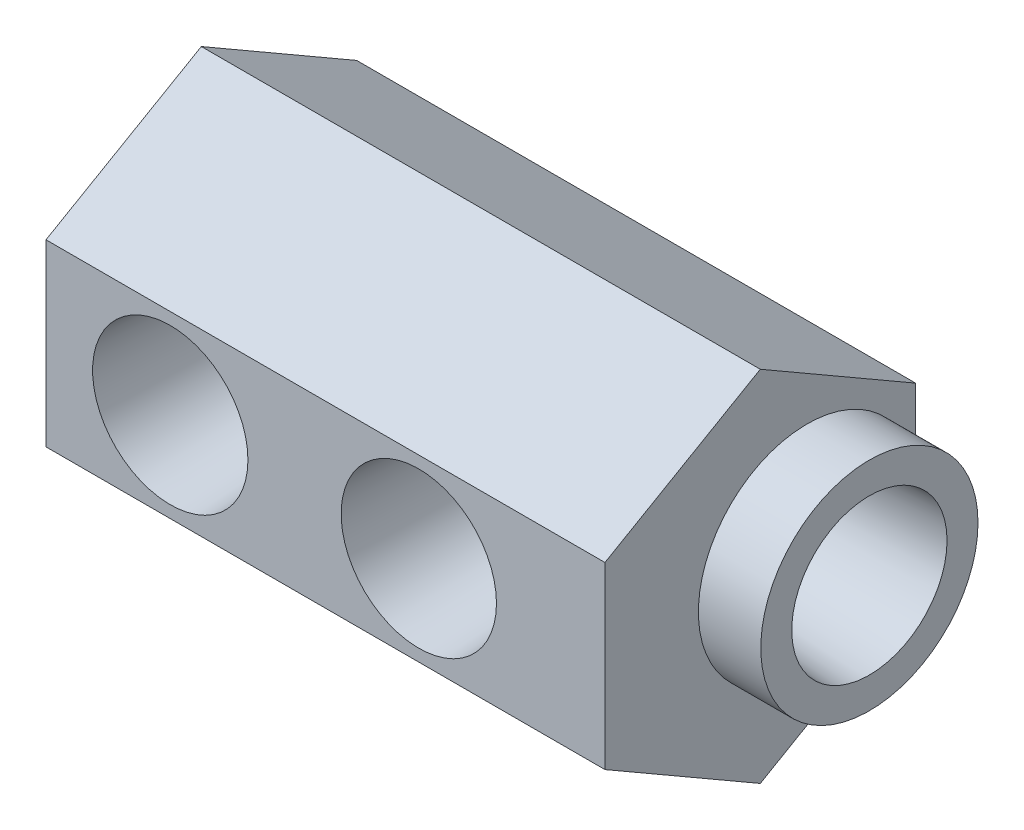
ISO-10303-21;
HEADER;
FILE_DESCRIPTION(('STEP AP214'),'2;1');
FILE_NAME('part.step','',(''),(''),'','','');
FILE_SCHEMA(('AUTOMOTIVE_DESIGN { 1 0 10303 214 1 1 1 1 }'));
ENDSEC;
DATA;
#1=APPLICATION_CONTEXT('core data for automotive mechanical design processes');
#2=APPLICATION_PROTOCOL_DEFINITION('international standard','automotive_design',2000,#1);
#3=PRODUCT_CONTEXT('',#1,'mechanical');
#4=PRODUCT('Part','Part','',(#3));
#5=PRODUCT_RELATED_PRODUCT_CATEGORY('part','',(#4));
#6=PRODUCT_DEFINITION_FORMATION('','',#4);
#7=PRODUCT_DEFINITION_CONTEXT('part definition',#1,'design');
#8=PRODUCT_DEFINITION('design','',#6,#7);
#9=PRODUCT_DEFINITION_SHAPE('','',#8);
#10=(LENGTH_UNIT() NAMED_UNIT(*) SI_UNIT(.MILLI.,.METRE.));
#11=(NAMED_UNIT(*) PLANE_ANGLE_UNIT() SI_UNIT($,.RADIAN.));
#12=(NAMED_UNIT(*) SI_UNIT($,.STERADIAN.) SOLID_ANGLE_UNIT());
#13=UNCERTAINTY_MEASURE_WITH_UNIT(LENGTH_MEASURE(1.E-05),#10,'distance_accuracy_value','');
#14=(GEOMETRIC_REPRESENTATION_CONTEXT(3) GLOBAL_UNCERTAINTY_ASSIGNED_CONTEXT((#13)) GLOBAL_UNIT_ASSIGNED_CONTEXT((#10,
#11,#12)) REPRESENTATION_CONTEXT('',''));
#15=CARTESIAN_POINT('',(0.,0.,0.));
#16=DIRECTION('',(0.,0.,1.));
#17=DIRECTION('',(1.,0.,0.));
#18=AXIS2_PLACEMENT_3D('',#15,#16,#17);
#19=CARTESIAN_POINT('',(9.39799990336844,0.,3.33536219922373));
#20=DIRECTION('',(1.,0.,0.));
#21=DIRECTION('',(0.,0.,-1.));
#22=AXIS2_PLACEMENT_3D('',#19,#20,#21);
#23=PLANE('',#22);
#24=DIRECTION('',(0.,1.,0.));
#25=VECTOR('',#24,1.);
#26=CARTESIAN_POINT('',(9.39799990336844,0.,4.21608249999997));
#27=LINE('',#26,#25);
#28=CARTESIAN_POINT('',(9.39799990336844,-0.889000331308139,4.21608249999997));
#29=VERTEX_POINT('',#28);
#30=CARTESIAN_POINT('',(9.39799990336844,0.889000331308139,4.21608249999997));
#31=VERTEX_POINT('',#30);
#32=EDGE_CURVE('E11',#29,#31,#27,.T.);
#33=ORIENTED_EDGE('',*,*,#32,.F.);
#34=DIRECTION('',(0.,0.,1.));
#35=VECTOR('',#34,1.);
#36=CARTESIAN_POINT('',(9.39799990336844,-0.889000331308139,19.8052254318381));
#37=LINE('',#36,#35);
#38=CARTESIAN_POINT('',(9.39799990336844,-0.889000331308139,4.55639409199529));
#39=VERTEX_POINT('',#38);
#40=EDGE_CURVE('E175',#39,#29,#37,.F.);
#41=ORIENTED_EDGE('',*,*,#40,.F.);
#42=CARTESIAN_POINT('',(9.39799990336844,0.,5.5499));
#43=DIRECTION('',(1.,0.,0.));
#44=DIRECTION('',(0.,0.,-1.));
#45=AXIS2_PLACEMENT_3D('',#42,#43,#44);
#46=CIRCLE('',#45,1.3331825);
#47=CARTESIAN_POINT('',(9.39799990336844,-0.889000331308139,6.54340590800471));
#48=VERTEX_POINT('',#47);
#49=EDGE_CURVE('E194',#39,#48,#46,.F.);
#50=ORIENTED_EDGE('',*,*,#49,.T.);
#51=CARTESIAN_POINT('',(9.39799990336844,-0.889000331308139,7.36297774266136));
#52=VERTEX_POINT('',#51);
#53=EDGE_CURVE('E174',#52,#48,#37,.F.);
#54=ORIENTED_EDGE('',*,*,#53,.F.);
#55=CARTESIAN_POINT('',(9.39799990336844,0.,5.5499));
#56=DIRECTION('',(1.,0.,0.));
#57=DIRECTION('',(0.,0.,-1.));
#58=AXIS2_PLACEMENT_3D('',#55,#56,#57);
#59=CIRCLE('',#58,2.0193);
#60=CARTESIAN_POINT('',(9.39799990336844,0.889000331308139,7.36297774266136));
#61=VERTEX_POINT('',#60);
#62=EDGE_CURVE('E195',#52,#61,#59,.T.);
#63=ORIENTED_EDGE('',*,*,#62,.T.);
#64=DIRECTION('',(0.,0.,1.));
#65=VECTOR('',#64,1.);
#66=CARTESIAN_POINT('',(9.39799990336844,0.889000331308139,19.8052254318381));
#67=LINE('',#66,#65);
#68=CARTESIAN_POINT('',(9.39799990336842,0.889000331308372,6.54340590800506));
#69=VERTEX_POINT('',#68);
#70=EDGE_CURVE('E111',#69,#61,#67,.T.);
#71=ORIENTED_EDGE('',*,*,#70,.F.);
#72=CARTESIAN_POINT('',(9.39799990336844,0.889000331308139,4.55639409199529));
#73=VERTEX_POINT('',#72);
#74=EDGE_CURVE('E198',#69,#73,#46,.F.);
#75=ORIENTED_EDGE('',*,*,#74,.T.);
#76=EDGE_CURVE('E533',#31,#73,#67,.T.);
#77=ORIENTED_EDGE('',*,*,#76,.F.);
#78=EDGE_LOOP('',(#33,#41,#50,#54,#63,#71,#75,#77));
#79=FACE_BOUND('',#78,.T.);
#80=ADVANCED_FACE('F17',(#79),#23,.T.);
#81=CARTESIAN_POINT('',(6.35,0.,19.8052254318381));
#82=DIRECTION('',(0.,0.,1.));
#83=DIRECTION('',(1.,0.,0.));
#84=AXIS2_PLACEMENT_3D('',#81,#82,#83);
#85=CYLINDRICAL_SURFACE('',#84,3.175);
#86=CARTESIAN_POINT('',(6.35,0.,7.9371825));
#87=DIRECTION('',(0.,0.,1.));
#88=DIRECTION('',(1.,0.,0.));
#89=AXIS2_PLACEMENT_3D('',#86,#87,#88);
#90=CIRCLE('',#89,3.175);
#91=CARTESIAN_POINT('',(9.525,0.,7.9371825));
#92=VERTEX_POINT('',#91);
#93=EDGE_CURVE('E131',#92,#92,#90,.T.);
#94=ORIENTED_EDGE('',*,*,#93,.T.);
#95=EDGE_LOOP('',(#94));
#96=FACE_BOUND('',#95,.T.);
#97=CARTESIAN_POINT('',(9.39799990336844,-0.889000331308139,7.36297774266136));
#98=CARTESIAN_POINT('',(9.41071185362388,-0.845420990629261,7.38434426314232));
#99=CARTESIAN_POINT('',(9.42267780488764,-0.800908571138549,7.40422073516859));
#100=CARTESIAN_POINT('',(9.44490964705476,-0.710172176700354,7.44083291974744));
#101=CARTESIAN_POINT('',(9.45517461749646,-0.663947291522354,7.45756693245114));
#102=CARTESIAN_POINT('',(9.48308342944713,-0.523021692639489,7.5027774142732));
#103=CARTESIAN_POINT('',(9.49784491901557,-0.426057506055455,7.52626851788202));
#104=CARTESIAN_POINT('',(9.51833226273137,-0.228469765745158,7.55873965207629));
#105=CARTESIAN_POINT('',(9.52402784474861,-0.127835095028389,7.56767106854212));
#106=CARTESIAN_POINT('',(9.52574094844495,0.0736474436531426,7.57036538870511));
#107=CARTESIAN_POINT('',(9.52176745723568,0.174495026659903,7.56414237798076));
#108=CARTESIAN_POINT('',(9.50493333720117,0.368988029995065,7.53752387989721));
#109=CARTESIAN_POINT('',(9.49246567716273,0.462756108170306,7.51775485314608));
#110=CARTESIAN_POINT('',(9.46011167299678,0.645294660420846,7.46566632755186));
#111=CARTESIAN_POINT('',(9.44023258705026,0.734069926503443,7.43335910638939));
#112=CARTESIAN_POINT('',(9.41116730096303,0.842899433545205,7.3850450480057));
#113=CARTESIAN_POINT('',(9.40468573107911,0.866087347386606,7.37421543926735));
#114=CARTESIAN_POINT('',(9.39799990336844,0.889000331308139,7.36297774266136));
#115=B_SPLINE_CURVE_WITH_KNOTS('',3,(#97,#98,#99,#100,#101,#102,#103,#104,#105,#106,#107,#108,
#109,#110,#111,#112,#113,#114),.UNSPECIFIED.,.F.,.F.,(4,2,2,2,2,2,2,2,4),(0.,0.150448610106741,
0.300978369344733,0.601994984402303,0.904014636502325,1.20575367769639,1.49440434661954,
1.78277307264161,1.86194685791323),.UNSPECIFIED.);
#116=EDGE_CURVE('E24',#52,#61,#115,.T.);
#117=ORIENTED_EDGE('',*,*,#116,.F.);
#118=ORIENTED_EDGE('',*,*,#53,.T.);
#119=CARTESIAN_POINT('',(9.525,0.,6.8830825));
#120=CARTESIAN_POINT('',(9.52499408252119,0.0713665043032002,6.88307465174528));
#121=CARTESIAN_POINT('',(9.52256596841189,0.142842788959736,6.87731811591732));
#122=CARTESIAN_POINT('',(9.51308742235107,0.283767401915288,6.85449749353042));
#123=CARTESIAN_POINT('',(9.50602503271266,0.353209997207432,6.83740415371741));
#124=CARTESIAN_POINT('',(9.48803626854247,0.487796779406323,6.79265472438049));
#125=CARTESIAN_POINT('',(9.47712307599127,0.552954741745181,6.76503464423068));
#126=CARTESIAN_POINT('',(9.45249294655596,0.677648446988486,6.70016555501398));
#127=CARTESIAN_POINT('',(9.43877683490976,0.737185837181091,6.6629193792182));
#128=CARTESIAN_POINT('',(9.40913120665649,0.852069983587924,6.57785674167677));
#129=CARTESIAN_POINT('',(9.39312847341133,0.907093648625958,6.52962966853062));
#130=CARTESIAN_POINT('',(9.36102774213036,1.00855050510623,6.42484275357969));
#131=CARTESIAN_POINT('',(9.34492969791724,1.05497910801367,6.36827848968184));
#132=CARTESIAN_POINT('',(9.31355689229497,1.14022995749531,6.24498529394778));
#133=CARTESIAN_POINT('',(9.2983639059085,1.17855397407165,6.177888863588));
#134=CARTESIAN_POINT('',(9.27168497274,1.24322763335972,6.03747205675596));
#135=CARTESIAN_POINT('',(9.26019708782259,1.26958353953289,5.96415495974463));
#136=CARTESIAN_POINT('',(9.24302277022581,1.30823334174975,5.81709718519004));
#137=CARTESIAN_POINT('',(9.23708103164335,1.32114960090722,5.74355105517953));
#138=CARTESIAN_POINT('',(9.23093891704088,1.33449455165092,5.59511387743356));
#139=CARTESIAN_POINT('',(9.23073530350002,1.3349302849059,5.52022361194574));
#140=CARTESIAN_POINT('',(9.23587671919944,1.32377003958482,5.37746833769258));
#141=CARTESIAN_POINT('',(9.24078972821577,1.31311089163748,5.30951138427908));
#142=CARTESIAN_POINT('',(9.25487976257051,1.2816367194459,5.17645871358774));
#143=CARTESIAN_POINT('',(9.26405761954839,1.26081971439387,5.11136355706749));
#144=CARTESIAN_POINT('',(9.28585141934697,1.20921355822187,4.98422522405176));
#145=CARTESIAN_POINT('',(9.29853683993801,1.17822022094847,4.9222773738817));
#146=CARTESIAN_POINT('',(9.32590087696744,1.10728579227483,4.80421836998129));
#147=CARTESIAN_POINT('',(9.34058028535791,1.06734114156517,4.74810955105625));
#148=CARTESIAN_POINT('',(9.37181300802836,0.975608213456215,4.63824515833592));
#149=CARTESIAN_POINT('',(9.38841893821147,0.923097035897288,4.58510641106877));
#150=CARTESIAN_POINT('',(9.42057058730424,0.80974657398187,4.4881804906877));
#151=CARTESIAN_POINT('',(9.43611604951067,0.748905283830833,4.44439557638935));
#152=CARTESIAN_POINT('',(9.46485943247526,0.618722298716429,4.36649636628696));
#153=CARTESIAN_POINT('',(9.47799276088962,0.549212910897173,4.33263671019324));
#154=CARTESIAN_POINT('',(9.49993478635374,0.404792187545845,4.27730855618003));
#155=CARTESIAN_POINT('',(9.50874591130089,0.329883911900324,4.25583310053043));
#156=CARTESIAN_POINT('',(9.520595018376,0.18194332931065,4.22718264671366));
#157=CARTESIAN_POINT('',(9.52396650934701,0.109097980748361,4.21918008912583));
#158=CARTESIAN_POINT('',(9.52562380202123,-0.0369669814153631,4.21523073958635));
#159=CARTESIAN_POINT('',(9.52391109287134,-0.110186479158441,4.21928041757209));
#160=CARTESIAN_POINT('',(9.51580826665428,-0.251021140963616,4.23873145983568));
#161=CARTESIAN_POINT('',(9.50965907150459,-0.318732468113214,4.25354839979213));
#162=CARTESIAN_POINT('',(9.4935605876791,-0.450632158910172,4.29329637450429));
#163=CARTESIAN_POINT('',(9.48361082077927,-0.514820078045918,4.31822868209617));
#164=CARTESIAN_POINT('',(9.46047812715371,-0.640107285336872,4.37831316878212));
#165=CARTESIAN_POINT('',(9.44720421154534,-0.701048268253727,4.41375927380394));
#166=CARTESIAN_POINT('',(9.41883547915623,-0.816335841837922,4.4935426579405));
#167=CARTESIAN_POINT('',(9.4037398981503,-0.870679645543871,4.53788367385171));
#168=CARTESIAN_POINT('',(9.37199865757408,-0.975374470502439,4.63795893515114));
#169=CARTESIAN_POINT('',(9.35531998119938,-1.0251500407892,4.69428625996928));
#170=CARTESIAN_POINT('',(9.3232679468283,-1.11470658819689,4.81475419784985));
#171=CARTESIAN_POINT('',(9.3078949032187,-1.15448516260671,4.8788966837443));
#172=CARTESIAN_POINT('',(9.28007838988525,-1.22338594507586,5.01457313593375));
#173=CARTESIAN_POINT('',(9.26768304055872,-1.25233684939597,5.08620469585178));
#174=CARTESIAN_POINT('',(9.24787792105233,-1.29751622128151,5.23401102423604));
#175=CARTESIAN_POINT('',(9.24046395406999,-1.31375540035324,5.3101819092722));
#176=CARTESIAN_POINT('',(9.23210873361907,-1.33197803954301,5.45850909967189));
#177=CARTESIAN_POINT('',(9.23070810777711,-1.33497378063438,5.53051569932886));
#178=CARTESIAN_POINT('',(9.23331441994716,-1.32933556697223,5.67396483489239));
#179=CARTESIAN_POINT('',(9.23732049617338,-1.32070346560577,5.74540745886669));
#180=CARTESIAN_POINT('',(9.24986617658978,-1.29290931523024,5.88216310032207));
#181=CARTESIAN_POINT('',(9.25817889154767,-1.27427270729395,5.94760572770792));
#182=CARTESIAN_POINT('',(9.27821978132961,-1.227516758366,6.07444791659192));
#183=CARTESIAN_POINT('',(9.28994891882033,-1.19939474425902,6.13584633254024));
#184=CARTESIAN_POINT('',(9.31638281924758,-1.13250349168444,6.25692296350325));
#185=CARTESIAN_POINT('',(9.33122490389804,-1.093191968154,6.31627102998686));
#186=CARTESIAN_POINT('',(9.36183542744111,-1.0057906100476,6.42784477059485));
#187=CARTESIAN_POINT('',(9.37760419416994,-0.957697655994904,6.48006790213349));
#188=CARTESIAN_POINT('',(9.40970138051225,-0.849849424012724,6.57991151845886));
#189=CARTESIAN_POINT('',(9.42598405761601,-0.789492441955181,6.62689983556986));
#190=CARTESIAN_POINT('',(9.45609795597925,-0.661149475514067,6.71011726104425));
#191=CARTESIAN_POINT('',(9.46992806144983,-0.593160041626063,6.74634147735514));
#192=CARTESIAN_POINT('',(9.49338647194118,-0.452493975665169,6.80623479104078));
#193=CARTESIAN_POINT('',(9.50307860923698,-0.379910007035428,6.83009593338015));
#194=CARTESIAN_POINT('',(9.51742813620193,-0.231395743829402,6.86504754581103));
#195=CARTESIAN_POINT('',(9.52210124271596,-0.155476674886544,6.87617788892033));
#196=CARTESIAN_POINT('',(9.52467209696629,-0.0528508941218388,6.88229968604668));
#197=CARTESIAN_POINT('',(9.52500219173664,-0.0264329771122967,6.88308540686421));
#198=CARTESIAN_POINT('',(9.525,0.,6.8830825));
#199=B_SPLINE_CURVE_WITH_KNOTS('',3,(#119,#120,#121,#122,#123,#124,#125,#126,#127,#128,#129,
#130,#131,#132,#133,#134,#135,#136,#137,#138,#139,#140,#141,#142,#143,#144,#145,#146,#147,#148,
#149,#150,#151,#152,#153,#154,#155,#156,#157,#158,#159,#160,#161,#162,#163,#164,#165,#166,#167,
#168,#169,#170,#171,#172,#173,#174,#175,#176,#177,#178,#179,#180,#181,#182,#183,#184,#185,#186,
#187,#188,#189,#190,#191,#192,#193,#194,#195,#196,#197,#198),.UNSPECIFIED.,.T.,.F.,(4,2,2,2,2,2,
2,2,2,2,2,2,2,2,2,2,2,2,2,2,2,2,2,2,2,2,2,2,2,2,2,2,2,2,2,2,2,2,2,4),(0.,0.214023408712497,
0.428601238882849,0.642451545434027,0.856238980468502,1.07995636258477,1.303792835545,
1.53885474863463,1.77379350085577,1.99728968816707,2.22065977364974,2.42658817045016,
2.63255673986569,2.84294019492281,3.05340745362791,3.28196554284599,3.51057876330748,
3.74462670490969,3.97854302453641,4.19748275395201,4.41635836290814,4.62416518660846,
4.83199816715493,5.0462996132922,5.26069127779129,5.49063228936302,5.72062851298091,
5.95412332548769,6.18742117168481,6.40253901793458,6.61762258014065,6.82237994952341,
7.02719507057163,7.24443153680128,7.46174532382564,7.69523879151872,7.9288382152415,
8.15869110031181,8.38782209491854,8.46709283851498),.UNSPECIFIED.);
#200=EDGE_CURVE('E141',#39,#48,#199,.T.);
#201=ORIENTED_EDGE('',*,*,#200,.F.);
#202=ORIENTED_EDGE('',*,*,#40,.T.);
#203=CARTESIAN_POINT('',(6.35,0.,4.21608249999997));
#204=DIRECTION('',(0.,0.,1.));
#205=DIRECTION('',(1.,0.,0.));
#206=AXIS2_PLACEMENT_3D('',#203,#204,#205);
#207=CIRCLE('',#206,3.175);
#208=EDGE_CURVE('E150',#31,#29,#207,.T.);
#209=ORIENTED_EDGE('',*,*,#208,.F.);
#210=ORIENTED_EDGE('',*,*,#76,.T.);
#211=EDGE_CURVE('E149',#69,#73,#199,.T.);
#212=ORIENTED_EDGE('',*,*,#211,.F.);
#213=ORIENTED_EDGE('',*,*,#70,.T.);
#214=EDGE_LOOP('',(#117,#118,#201,#202,#209,#210,#212,#213));
#215=FACE_BOUND('',#214,.T.);
#216=ADVANCED_FACE('F156',(#96,#215),#85,.F.);
#217=CARTESIAN_POINT('',(34.4178903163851,0.,5.5499));
#218=DIRECTION('',(1.,0.,0.));
#219=DIRECTION('',(0.,0.,-1.));
#220=AXIS2_PLACEMENT_3D('',#217,#218,#219);
#221=CYLINDRICAL_SURFACE('',#220,1.3331825);
#222=ORIENTED_EDGE('',*,*,#211,.T.);
#223=ORIENTED_EDGE('',*,*,#74,.F.);
#224=EDGE_LOOP('',(#222,#223));
#225=FACE_BOUND('',#224,.T.);
#226=ADVANCED_FACE('F161',(#225),#221,.F.);
#227=CARTESIAN_POINT('',(19.05,0.,19.8052254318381));
#228=DIRECTION('',(0.,0.,1.));
#229=DIRECTION('',(1.,0.,0.));
#230=AXIS2_PLACEMENT_3D('',#227,#228,#229);
#231=CYLINDRICAL_SURFACE('',#230,3.175);
#232=CARTESIAN_POINT('',(19.05,0.,2.89274250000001));
#233=DIRECTION('',(0.,0.,1.));
#234=DIRECTION('',(1.,0.,0.));
#235=AXIS2_PLACEMENT_3D('',#232,#233,#234);
#236=CIRCLE('',#235,3.175);
#237=CARTESIAN_POINT('',(22.225,0.,2.8927425));
#238=VERTEX_POINT('',#237);
#239=EDGE_CURVE('E196',#238,#238,#236,.T.);
#240=ORIENTED_EDGE('',*,*,#239,.F.);
#241=EDGE_LOOP('',(#240));
#242=FACE_BOUND('',#241,.T.);
#243=CARTESIAN_POINT('',(19.05,0.,7.9371825));
#244=DIRECTION('',(0.,0.,1.));
#245=DIRECTION('',(1.,0.,0.));
#246=AXIS2_PLACEMENT_3D('',#243,#244,#245);
#247=CIRCLE('',#246,3.175);
#248=CARTESIAN_POINT('',(22.0054076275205,-1.16025460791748,7.9371825));
#249=VERTEX_POINT('',#248);
#250=CARTESIAN_POINT('',(22.0054076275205,1.16025460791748,7.9371825));
#251=VERTEX_POINT('',#250);
#252=EDGE_CURVE('E119',#249,#251,#247,.F.);
#253=ORIENTED_EDGE('',*,*,#252,.F.);
#254=CARTESIAN_POINT('',(22.0054076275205,-1.16025460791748,7.9371825));
#255=CARTESIAN_POINT('',(21.9770071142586,-1.23260455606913,7.90201427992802));
#256=CARTESIAN_POINT('',(21.9464621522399,-1.30259122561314,7.86394026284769));
#257=CARTESIAN_POINT('',(21.8818737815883,-1.43760355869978,7.78256915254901));
#258=CARTESIAN_POINT('',(21.847835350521,-1.50263605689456,7.73927947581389));
#259=CARTESIAN_POINT('',(21.7418041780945,-1.68976628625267,7.60265650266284));
#260=CARTESIAN_POINT('',(21.6656662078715,-1.80445359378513,7.50229120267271));
#261=CARTESIAN_POINT('',(21.5087494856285,-2.01298089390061,7.28646906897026));
#262=CARTESIAN_POINT('',(21.4279978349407,-2.10692947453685,7.17109612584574));
#263=CARTESIAN_POINT('',(21.307999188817,-2.23281132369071,6.98704162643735));
#264=CARTESIAN_POINT('',(21.2681548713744,-2.27229185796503,6.92380000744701));
#265=CARTESIAN_POINT('',(21.189919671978,-2.34611547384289,6.79354611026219));
#266=CARTESIAN_POINT('',(21.1515282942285,-2.38046031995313,6.72653513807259));
#267=CARTESIAN_POINT('',(21.0658803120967,-2.45375848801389,6.56692289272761));
#268=CARTESIAN_POINT('',(21.0196139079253,-2.49078524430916,6.47288100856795));
#269=CARTESIAN_POINT('',(20.9360657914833,-2.55463188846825,6.27767642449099));
#270=CARTESIAN_POINT('',(20.8987625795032,-2.58147629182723,6.17653153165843));
#271=CARTESIAN_POINT('',(20.8450711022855,-2.61900697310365,5.98943674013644));
#272=CARTESIAN_POINT('',(20.8259375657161,-2.63190094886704,5.90474707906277));
#273=CARTESIAN_POINT('',(20.7997334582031,-2.64940038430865,5.73272409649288));
#274=CARTESIAN_POINT('',(20.7926414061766,-2.65402060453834,5.64539576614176));
#275=CARTESIAN_POINT('',(20.7918273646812,-2.65455522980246,5.47042332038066));
#276=CARTESIAN_POINT('',(20.7981392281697,-2.65044759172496,5.38277896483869));
#277=CARTESIAN_POINT('',(20.8229862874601,-2.63388538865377,5.21001115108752));
#278=CARTESIAN_POINT('',(20.8415434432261,-2.62141582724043,5.12489250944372));
#279=CARTESIAN_POINT('',(20.8978402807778,-2.58218975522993,4.92371119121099));
#280=CARTESIAN_POINT('',(20.9403727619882,-2.5516220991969,4.80977766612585));
#281=CARTESIAN_POINT('',(21.0362802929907,-2.47769804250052,4.59085388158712));
#282=CARTESIAN_POINT('',(21.089694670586,-2.43429498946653,4.48589807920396));
#283=CARTESIAN_POINT('',(21.1877862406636,-2.34811849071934,4.30944146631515));
#284=CARTESIAN_POINT('',(21.2313626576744,-2.30783762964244,4.23608062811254));
#285=CARTESIAN_POINT('',(21.3197745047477,-2.220945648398,4.09399808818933));
#286=CARTESIAN_POINT('',(21.3646105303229,-2.17433149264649,4.02527863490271));
#287=CARTESIAN_POINT('',(21.4988882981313,-2.02518932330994,3.82611611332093));
#288=CARTESIAN_POINT('',(21.588250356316,-1.9132369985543,3.70241574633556));
#289=CARTESIAN_POINT('',(21.741836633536,-1.68807765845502,3.49702587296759));
#290=CARTESIAN_POINT('',(21.8076173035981,-1.57911939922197,3.41181639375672));
#291=CARTESIAN_POINT('',(21.928916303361,-1.34525902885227,3.25749322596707));
#292=CARTESIAN_POINT('',(21.9844524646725,-1.22038527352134,3.18835151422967));
#293=CARTESIAN_POINT('',(22.0719007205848,-0.980756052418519,3.08061794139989));
#294=CARTESIAN_POINT('',(22.1062810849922,-0.868385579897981,3.0387430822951));
#295=CARTESIAN_POINT('',(22.1629031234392,-0.636162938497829,2.97012696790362));
#296=CARTESIAN_POINT('',(22.1851518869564,-0.516315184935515,2.94337687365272));
#297=CARTESIAN_POINT('',(22.2157639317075,-0.271695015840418,2.90663511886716));
#298=CARTESIAN_POINT('',(22.2240604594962,-0.146901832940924,2.89672402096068));
#299=CARTESIAN_POINT('',(22.2257873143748,0.102933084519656,2.89465806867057));
#300=CARTESIAN_POINT('',(22.219219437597,0.227974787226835,2.90250106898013));
#301=CARTESIAN_POINT('',(22.1929120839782,0.464544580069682,2.93405474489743));
#302=CARTESIAN_POINT('',(22.1742335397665,0.576368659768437,2.95648774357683));
#303=CARTESIAN_POINT('',(22.1261286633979,0.794035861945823,3.01464523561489));
#304=CARTESIAN_POINT('',(22.0967007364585,0.899878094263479,3.05037170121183));
#305=CARTESIAN_POINT('',(22.0264014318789,1.11129153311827,3.13653734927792));
#306=CARTESIAN_POINT('',(21.9848468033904,1.21626850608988,3.18786642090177));
#307=CARTESIAN_POINT('',(21.8938485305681,1.41606511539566,3.30193860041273));
#308=CARTESIAN_POINT('',(21.844398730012,1.51087672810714,3.36469062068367));
#309=CARTESIAN_POINT('',(21.7148281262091,1.732851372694,3.53244728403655));
#310=CARTESIAN_POINT('',(21.6313701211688,1.85372768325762,3.64328406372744));
#311=CARTESIAN_POINT('',(21.5027402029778,2.01731239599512,3.82295229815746));
#312=CARTESIAN_POINT('',(21.459219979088,2.06895153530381,3.88518356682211));
#313=CARTESIAN_POINT('',(21.3720603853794,2.16631541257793,4.01403088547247));
#314=CARTESIAN_POINT('',(21.3284210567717,2.21204198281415,4.08064556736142));
#315=CARTESIAN_POINT('',(21.2180405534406,2.32145678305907,4.25677962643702));
#316=CARTESIAN_POINT('',(21.1520346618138,2.38088043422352,4.36945122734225));
#317=CARTESIAN_POINT('',(21.0288668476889,2.48417281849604,4.60608628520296));
#318=CARTESIAN_POINT('',(20.9716788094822,2.52808800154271,4.73001460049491));
#319=CARTESIAN_POINT('',(20.8932279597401,2.58546164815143,4.94318027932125));
#320=CARTESIAN_POINT('',(20.8664375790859,2.60419442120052,5.02890883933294));
#321=CARTESIAN_POINT('',(20.8241105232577,2.63321565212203,5.20442140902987));
#322=CARTESIAN_POINT('',(20.8085471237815,2.64352417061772,5.29419524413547));
#323=CARTESIAN_POINT('',(20.791391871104,2.65486496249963,5.47650488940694));
#324=CARTESIAN_POINT('',(20.7899184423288,2.65581861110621,5.56905756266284));
#325=CARTESIAN_POINT('',(20.8015850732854,2.64813304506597,5.75284790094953));
#326=CARTESIAN_POINT('',(20.8147395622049,2.6394843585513,5.84408417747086));
#327=CARTESIAN_POINT('',(20.8572406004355,2.61060838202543,6.04194245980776));
#328=CARTESIAN_POINT('',(20.8894828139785,2.58827473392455,6.1476036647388));
#329=CARTESIAN_POINT('',(20.9655224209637,2.53250992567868,6.35176733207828));
#330=CARTESIAN_POINT('',(21.0093651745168,2.49903506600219,6.45023971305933));
#331=CARTESIAN_POINT('',(21.0938337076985,2.43016812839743,6.62050770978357));
#332=CARTESIAN_POINT('',(21.1332847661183,2.39656706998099,6.69364143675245));
#333=CARTESIAN_POINT('',(21.214483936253,2.32349236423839,6.83561794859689));
#334=CARTESIAN_POINT('',(21.2562332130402,2.28401572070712,6.90445851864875));
#335=CARTESIAN_POINT('',(21.3405847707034,2.19941243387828,7.03789419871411));
#336=CARTESIAN_POINT('',(21.3831862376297,2.15429098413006,7.10249312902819));
#337=CARTESIAN_POINT('',(21.4681849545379,2.05842450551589,7.22751772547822));
#338=CARTESIAN_POINT('',(21.5105822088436,2.00767959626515,7.28794348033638));
#339=CARTESIAN_POINT('',(21.5949732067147,1.89961057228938,7.40550639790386));
#340=CARTESIAN_POINT('',(21.6369462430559,1.84218519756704,7.4625656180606));
#341=CARTESIAN_POINT('',(21.7187543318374,1.72153637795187,7.57184014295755));
#342=CARTESIAN_POINT('',(21.7585902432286,1.65831529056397,7.62405740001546));
#343=CARTESIAN_POINT('',(21.8353154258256,1.52594294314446,7.72329877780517));
#344=CARTESIAN_POINT('',(21.8721977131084,1.45677838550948,7.77031068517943));
#345=CARTESIAN_POINT('',(21.9420212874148,1.31273444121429,7.85840007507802));
#346=CARTESIAN_POINT('',(21.9749559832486,1.23784582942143,7.89946765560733));
#347=CARTESIAN_POINT('',(22.0054076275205,1.16025460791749,7.9371825));
#348=B_SPLINE_CURVE_WITH_KNOTS('',3,(#254,#255,#256,#257,#258,#259,#260,#261,#262,#263,#264,
#265,#266,#267,#268,#269,#270,#271,#272,#273,#274,#275,#276,#277,#278,#279,#280,#281,#282,#283,
#284,#285,#286,#287,#288,#289,#290,#291,#292,#293,#294,#295,#296,#297,#298,#299,#300,#301,#302,
#303,#304,#305,#306,#307,#308,#309,#310,#311,#312,#313,#314,#315,#316,#317,#318,#319,#320,#321,
#322,#323,#324,#325,#326,#327,#328,#329,#330,#331,#332,#333,#334,#335,#336,#337,#338,#339,#340,
#341,#342,#343,#344,#345,#346,#347),.UNSPECIFIED.,.F.,.F.,(4,2,2,2,2,2,2,2,2,2,2,2,2,2,2,2,2,2,
2,2,2,2,2,2,2,2,2,2,2,2,2,2,2,2,2,2,2,2,2,2,2,2,2,2,2,2,4),(0.,0.255673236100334,
0.51098711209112,1.01965391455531,1.52559059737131,1.77898388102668,2.03228990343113,
2.36494498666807,2.69679399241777,2.95906799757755,3.22087363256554,3.48334127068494,
3.74628088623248,4.12036890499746,4.49583367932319,4.77855647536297,5.06141526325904,
5.62618427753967,6.08404913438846,6.54110935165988,6.91382818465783,7.28632897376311,
7.66060694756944,8.03483969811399,8.38005133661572,8.7253142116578,9.09600896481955,
9.46699418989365,10.0158675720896,10.2911544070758,10.5663557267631,10.9955311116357,
11.4234099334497,11.6977524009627,11.9714396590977,12.247425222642,12.5236832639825,
12.8599266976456,13.1975048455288,13.4660694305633,13.7347714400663,14.0032280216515,
14.2716788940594,14.5449210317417,14.818052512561,15.0918118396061,15.366022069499),.UNSPECIFIED.);
#349=EDGE_CURVE('E428',#249,#251,#348,.T.);
#350=ORIENTED_EDGE('',*,*,#349,.T.);
#351=EDGE_LOOP('',(#253,#350));
#352=FACE_BOUND('',#351,.T.);
#353=CARTESIAN_POINT('',(15.875,0.,7.5692));
#354=CARTESIAN_POINT('',(15.8750078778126,-0.102275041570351,7.56919143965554));
#355=CARTESIAN_POINT('',(15.8799932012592,-0.204663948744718,7.56137696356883));
#356=CARTESIAN_POINT('',(15.8994648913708,-0.406278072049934,7.53054527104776));
#357=CARTESIAN_POINT('',(15.9139678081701,-0.505497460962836,7.50750157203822));
#358=CARTESIAN_POINT('',(15.9510205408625,-0.697469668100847,7.44757536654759));
#359=CARTESIAN_POINT('',(15.9735303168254,-0.790251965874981,7.41076167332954));
#360=CARTESIAN_POINT('',(16.0247398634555,-0.967983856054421,7.32481840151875));
#361=CARTESIAN_POINT('',(16.0534391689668,-1.05293403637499,7.27568974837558));
#362=CARTESIAN_POINT('',(16.1174372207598,-1.22039873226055,7.16212031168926));
#363=CARTESIAN_POINT('',(16.1530827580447,-1.3021541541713,7.09675956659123));
#364=CARTESIAN_POINT('',(16.226375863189,-1.45427585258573,6.95471514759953));
#365=CARTESIAN_POINT('',(16.264026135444,-1.52462619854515,6.87801591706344));
#366=CARTESIAN_POINT('',(16.3434696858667,-1.66206543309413,6.70281312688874));
#367=CARTESIAN_POINT('',(16.3850971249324,-1.72729055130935,6.60275997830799));
#368=CARTESIAN_POINT('',(16.4615113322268,-1.83983395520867,6.39069070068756));
#369=CARTESIAN_POINT('',(16.4963097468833,-1.88718285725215,6.27869545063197));
#370=CARTESIAN_POINT('',(16.5453620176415,-1.95156224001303,6.07625357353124));
#371=CARTESIAN_POINT('',(16.5626207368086,-1.97331282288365,5.98804159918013));
#372=CARTESIAN_POINT('',(16.5879026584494,-2.00477482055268,5.8082558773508));
#373=CARTESIAN_POINT('',(16.5959396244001,-2.01450417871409,5.71668735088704));
#374=CARTESIAN_POINT('',(16.6015591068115,-2.02133295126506,5.53247355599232));
#375=CARTESIAN_POINT('',(16.599110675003,-2.0183949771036,5.43982590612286));
#376=CARTESIAN_POINT('',(16.5840887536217,-2.00000919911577,5.25659107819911));
#377=CARTESIAN_POINT('',(16.5715069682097,-1.98455114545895,5.16600565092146));
#378=CARTESIAN_POINT('',(16.5385365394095,-1.94264067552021,4.99174339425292));
#379=CARTESIAN_POINT('',(16.518375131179,-1.916506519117,4.90794440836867));
#380=CARTESIAN_POINT('',(16.4724796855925,-1.85432038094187,4.7457731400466));
#381=CARTESIAN_POINT('',(16.4467437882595,-1.81826508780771,4.66740268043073));
#382=CARTESIAN_POINT('',(16.3866478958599,-1.72932876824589,4.50233579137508));
#383=CARTESIAN_POINT('',(16.3515803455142,-1.67454743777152,4.4169218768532));
#384=CARTESIAN_POINT('',(16.2799458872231,-1.55319088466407,4.25553486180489));
#385=CARTESIAN_POINT('',(16.2433772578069,-1.48660181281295,4.17957302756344));
#386=CARTESIAN_POINT('',(16.165251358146,-1.3296002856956,4.02547019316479));
#387=CARTESIAN_POINT('',(16.1239622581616,-1.2370571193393,3.94934035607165));
#388=CARTESIAN_POINT('',(16.0476533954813,-1.03819212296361,3.81376503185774));
#389=CARTESIAN_POINT('',(16.0126268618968,-0.931885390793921,3.7543014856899));
#390=CARTESIAN_POINT('',(15.9586823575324,-0.730092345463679,3.66464166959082));
#391=CARTESIAN_POINT('',(15.9379481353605,-0.636630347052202,3.6309818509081));
#392=CARTESIAN_POINT('',(15.9047486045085,-0.444413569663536,3.5775928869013));
#393=CARTESIAN_POINT('',(15.892276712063,-0.345663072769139,3.55785264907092));
#394=CARTESIAN_POINT('',(15.8767275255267,-0.145247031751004,3.53329454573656));
#395=CARTESIAN_POINT('',(15.8736804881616,-0.0435731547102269,3.52852473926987));
#396=CARTESIAN_POINT('',(15.8773716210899,0.159161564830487,3.5343297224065));
#397=CARTESIAN_POINT('',(15.8841105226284,0.260222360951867,3.54490565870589));
#398=CARTESIAN_POINT('',(15.9061304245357,0.453545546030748,3.57986601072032));
#399=CARTESIAN_POINT('',(15.9209606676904,0.545994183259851,3.60352258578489));
#400=CARTESIAN_POINT('',(15.9576168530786,0.725383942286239,3.66301671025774));
#401=CARTESIAN_POINT('',(15.9794439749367,0.812324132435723,3.69885631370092));
#402=CARTESIAN_POINT('',(16.0303734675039,0.985513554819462,3.78457530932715));
#403=CARTESIAN_POINT('',(16.0599023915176,1.07120913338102,3.83531408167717));
#404=CARTESIAN_POINT('',(16.1230249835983,1.23329766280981,3.94793071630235));
#405=CARTESIAN_POINT('',(16.1566218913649,1.30968310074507,4.00981747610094));
#406=CARTESIAN_POINT('',(16.2307468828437,1.46312883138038,4.15365409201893));
#407=CARTESIAN_POINT('',(16.2715541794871,1.5385399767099,4.23722295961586));
#408=CARTESIAN_POINT('',(16.35151421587,1.67482589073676,4.41623900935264));
#409=CARTESIAN_POINT('',(16.3906667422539,1.73569878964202,4.51168771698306));
#410=CARTESIAN_POINT('',(16.457576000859,1.83384260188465,4.69895126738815));
#411=CARTESIAN_POINT('',(16.4861615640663,1.87323995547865,4.7893485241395));
#412=CARTESIAN_POINT('',(16.5353802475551,1.93881492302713,4.9768369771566));
#413=CARTESIAN_POINT('',(16.5560245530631,1.96501114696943,5.07391852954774));
#414=CARTESIAN_POINT('',(16.5863370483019,2.00290039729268,5.27357278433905));
#415=CARTESIAN_POINT('',(16.5959049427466,2.01446098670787,5.37618699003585));
#416=CARTESIAN_POINT('',(16.601833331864,2.02166710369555,5.58233308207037));
#417=CARTESIAN_POINT('',(16.5982018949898,2.0173223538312,5.68586436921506));
#418=CARTESIAN_POINT('',(16.5798792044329,1.99481282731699,5.87572672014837));
#419=CARTESIAN_POINT('',(16.5667771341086,1.97863020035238,5.96246561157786));
#420=CARTESIAN_POINT('',(16.5331118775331,1.93562453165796,6.13176883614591));
#421=CARTESIAN_POINT('',(16.5125415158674,1.90879125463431,6.21432906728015));
#422=CARTESIAN_POINT('',(16.4581111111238,1.8345321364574,6.40161779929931));
#423=CARTESIAN_POINT('',(16.4221143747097,1.78319601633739,6.5041730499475));
#424=CARTESIAN_POINT('',(16.3456707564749,1.66498968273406,6.69807919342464));
#425=CARTESIAN_POINT('',(16.3052179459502,1.59809863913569,6.78941480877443));
#426=CARTESIAN_POINT('',(16.2237770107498,1.44926145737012,6.96064698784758));
#427=CARTESIAN_POINT('',(16.1827879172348,1.36715686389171,7.04040573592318));
#428=CARTESIAN_POINT('',(16.1046587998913,1.18954498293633,7.18566450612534));
#429=CARTESIAN_POINT('',(16.0675187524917,1.09403777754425,7.25116461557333));
#430=CARTESIAN_POINT('',(15.9998615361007,0.888385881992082,7.3671993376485));
#431=CARTESIAN_POINT('',(15.9695395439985,0.777927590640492,7.41730513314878));
#432=CARTESIAN_POINT('',(15.9326995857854,0.605427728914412,7.4772677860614));
#433=CARTESIAN_POINT('',(15.921865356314,0.546842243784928,7.49471471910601));
#434=CARTESIAN_POINT('',(15.9033887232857,0.427869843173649,7.5242977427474));
#435=CARTESIAN_POINT('',(15.8957440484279,0.367484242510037,7.53643761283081));
#436=CARTESIAN_POINT('',(15.8849274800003,0.255971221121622,7.55356340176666));
#437=CARTESIAN_POINT('',(15.8812140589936,0.205027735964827,7.55941801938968));
#438=CARTESIAN_POINT('',(15.8762483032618,0.102732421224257,7.56723852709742));
#439=CARTESIAN_POINT('',(15.8749960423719,0.0513805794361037,7.56920430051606));
#440=CARTESIAN_POINT('',(15.875,0.,7.5692));
#441=B_SPLINE_CURVE_WITH_KNOTS('',3,(#353,#354,#355,#356,#357,#358,#359,#360,#361,#362,#363,
#364,#365,#366,#367,#368,#369,#370,#371,#372,#373,#374,#375,#376,#377,#378,#379,#380,#381,#382,
#383,#384,#385,#386,#387,#388,#389,#390,#391,#392,#393,#394,#395,#396,#397,#398,#399,#400,#401,
#402,#403,#404,#405,#406,#407,#408,#409,#410,#411,#412,#413,#414,#415,#416,#417,#418,#419,#420,
#421,#422,#423,#424,#425,#426,#427,#428,#429,#430,#431,#432,#433,#434,#435,#436,#437,#438,#439,
#440),.UNSPECIFIED.,.T.,.F.,(4,2,2,2,2,2,2,2,2,2,2,2,2,2,2,2,2,2,2,2,2,2,2,2,2,2,2,2,2,2,2,2,2,
2,2,2,2,2,2,2,2,2,2,4),(0.,0.306618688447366,0.613771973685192,0.919410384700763,
1.2250258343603,1.55547991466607,1.88639166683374,2.26403741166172,2.64103340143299,
2.91733101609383,3.19321571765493,3.4699152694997,3.74684157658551,4.01605368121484,
4.28535574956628,4.60626536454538,4.92755389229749,5.30593192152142,5.683898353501,
5.98703820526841,6.28993621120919,6.59380561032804,6.89769771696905,7.18617094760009,
7.47469283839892,7.78512110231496,8.09579823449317,8.45351764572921,8.8112830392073,
9.11810928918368,9.42450177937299,9.73364742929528,10.0426041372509,10.3090843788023,
10.5758213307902,10.9345409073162,11.293743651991,11.65692257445,12.0200992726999,
12.3926282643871,12.5785937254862,12.7644265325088,12.9184599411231,13.0724979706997),.UNSPECIFIED.);
#442=CARTESIAN_POINT('',(15.875,0.,7.5692));
#443=VERTEX_POINT('',#442);
#444=EDGE_CURVE('E188',#443,#443,#441,.T.);
#445=ORIENTED_EDGE('',*,*,#444,.F.);
#446=EDGE_LOOP('',(#445));
#447=FACE_BOUND('',#446,.T.);
#448=ADVANCED_FACE('F165',(#242,#352,#447),#231,.F.);
#449=CARTESIAN_POINT('',(19.05,0.,2.8927425));
#450=DIRECTION('',(0.,0.,1.));
#451=DIRECTION('',(1.,0.,0.));
#452=AXIS2_PLACEMENT_3D('',#449,#450,#451);
#453=PLANE('',#452);
#454=ORIENTED_EDGE('',*,*,#239,.T.);
#455=EDGE_LOOP('',(#454));
#456=FACE_BOUND('',#455,.T.);
#457=ADVANCED_FACE('F184',(#456),#453,.T.);
#458=CARTESIAN_POINT('',(6.35,0.,4.21608249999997));
#459=DIRECTION('',(0.,0.,-1.));
#460=DIRECTION('',(-1.,0.,0.));
#461=AXIS2_PLACEMENT_3D('',#458,#459,#460);
#462=PLANE('',#461);
#463=ORIENTED_EDGE('',*,*,#208,.T.);
#464=ORIENTED_EDGE('',*,*,#32,.T.);
#465=EDGE_LOOP('',(#463,#464));
#466=FACE_BOUND('',#465,.T.);
#467=ADVANCED_FACE('F257',(#466),#462,.F.);
#468=ORIENTED_EDGE('',*,*,#200,.T.);
#469=ORIENTED_EDGE('',*,*,#49,.F.);
#470=EDGE_LOOP('',(#468,#469));
#471=FACE_BOUND('',#470,.T.);
#472=ADVANCED_FACE('F152',(#471),#221,.F.);
#473=CARTESIAN_POINT('',(23.8128175,0.,1.99743760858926));
#474=DIRECTION('',(1.,0.,0.));
#475=DIRECTION('',(0.,0.,-1.));
#476=AXIS2_PLACEMENT_3D('',#473,#474,#475);
#477=PLANE('',#476);
#478=CARTESIAN_POINT('',(23.8128175,0.,5.5499));
#479=DIRECTION('',(1.,0.,0.));
#480=DIRECTION('',(0.,0.,-1.));
#481=AXIS2_PLACEMENT_3D('',#478,#479,#480);
#482=CIRCLE('',#481,2.6543);
#483=CARTESIAN_POINT('',(23.8128175,0.,2.8956));
#484=VERTEX_POINT('',#483);
#485=EDGE_CURVE('E120',#484,#484,#482,.T.);
#486=ORIENTED_EDGE('',*,*,#485,.F.);
#487=EDGE_LOOP('',(#486));
#488=FACE_BOUND('',#487,.T.);
#489=CARTESIAN_POINT('',(23.8128174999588,0.,5.5499));
#490=DIRECTION('',(1.,0.,0.));
#491=DIRECTION('',(0.,0.,-1.));
#492=AXIS2_PLACEMENT_3D('',#489,#490,#491);
#493=CIRCLE('',#492,3.5524623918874);
#494=CARTESIAN_POINT('',(23.8128174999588,0.,1.9974376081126));
#495=VERTEX_POINT('',#494);
#496=EDGE_CURVE('E138',#495,#495,#493,.T.);
#497=ORIENTED_EDGE('',*,*,#496,.T.);
#498=EDGE_LOOP('',(#497));
#499=FACE_BOUND('',#498,.T.);
#500=ADVANCED_FACE('F224',(#488,#499),#477,.T.);
#501=CARTESIAN_POINT('',(31.7499999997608,0.,5.5499));
#502=DIRECTION('',(1.,0.,0.));
#503=DIRECTION('',(0.,0.,-1.));
#504=AXIS2_PLACEMENT_3D('',#501,#502,#503);
#505=CONICAL_SURFACE('',#504,3.96843249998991,0.0523598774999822);
#506=CARTESIAN_POINT('',(31.7499999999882,0.,5.5499));
#507=DIRECTION('',(1.,0.,0.));
#508=DIRECTION('',(0.,0.,-1.));
#509=AXIS2_PLACEMENT_3D('',#506,#507,#508);
#510=CIRCLE('',#509,3.96843250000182);
#511=CARTESIAN_POINT('',(31.7499999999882,0.,1.58146749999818));
#512=VERTEX_POINT('',#511);
#513=EDGE_CURVE('E125',#512,#512,#510,.F.);
#514=ORIENTED_EDGE('',*,*,#513,.F.);
#515=EDGE_LOOP('',(#514));
#516=FACE_BOUND('',#515,.T.);
#517=ORIENTED_EDGE('',*,*,#496,.F.);
#518=EDGE_LOOP('',(#517));
#519=FACE_BOUND('',#518,.T.);
#520=ADVANCED_FACE('F163',(#516,#519),#505,.F.);
#521=CARTESIAN_POINT('',(22.225,0.,7.9371825));
#522=DIRECTION('',(0.,0.,1.));
#523=DIRECTION('',(1.,0.,0.));
#524=AXIS2_PLACEMENT_3D('',#521,#522,#523);
#525=PLANE('',#524);
#526=DIRECTION('',(1.,0.,0.));
#527=VECTOR('',#526,1.);
#528=CARTESIAN_POINT('',(20.6378175,-1.16025460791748,7.9371825));
#529=LINE('',#528,#527);
#530=CARTESIAN_POINT('',(22.4079836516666,-1.16025460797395,7.93718249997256));
#531=VERTEX_POINT('',#530);
#532=EDGE_CURVE('E107',#249,#531,#529,.T.);
#533=ORIENTED_EDGE('',*,*,#532,.F.);
#534=ORIENTED_EDGE('',*,*,#252,.T.);
#535=DIRECTION('',(1.,0.,0.));
#536=VECTOR('',#535,1.);
#537=CARTESIAN_POINT('',(20.6378175,1.16025460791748,7.9371825));
#538=LINE('',#537,#536);
#539=CARTESIAN_POINT('',(22.4079836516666,1.16025460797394,7.93718249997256));
#540=VERTEX_POINT('',#539);
#541=EDGE_CURVE('E104',#540,#251,#538,.F.);
#542=ORIENTED_EDGE('',*,*,#541,.F.);
#543=CARTESIAN_POINT('',(19.05,0.,7.93718249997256));
#544=DIRECTION('',(0.,0.,1.));
#545=DIRECTION('',(1.,0.,0.));
#546=AXIS2_PLACEMENT_3D('',#543,#544,#545);
#547=CIRCLE('',#546,3.55277989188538);
#548=EDGE_CURVE('E117',#540,#531,#547,.T.);
#549=ORIENTED_EDGE('',*,*,#548,.T.);
#550=EDGE_LOOP('',(#533,#534,#542,#549));
#551=FACE_BOUND('',#550,.T.);
#552=ADVANCED_FACE('F116',(#551),#525,.T.);
#553=CARTESIAN_POINT('',(3.175,0.,7.9371825));
#554=DIRECTION('',(0.,0.,-1.));
#555=DIRECTION('',(-1.,0.,0.));
#556=AXIS2_PLACEMENT_3D('',#553,#554,#555);
#557=PLANE('',#556);
#558=ORIENTED_EDGE('',*,*,#93,.F.);
#559=EDGE_LOOP('',(#558));
#560=FACE_BOUND('',#559,.T.);
#561=CARTESIAN_POINT('',(6.35,0.,7.93718249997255));
#562=DIRECTION('',(0.,0.,1.));
#563=DIRECTION('',(1.,0.,0.));
#564=AXIS2_PLACEMENT_3D('',#561,#562,#563);
#565=CIRCLE('',#564,3.55277989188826);
#566=CARTESIAN_POINT('',(9.90277989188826,0.,7.93718249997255));
#567=VERTEX_POINT('',#566);
#568=EDGE_CURVE('E124',#567,#567,#565,.T.);
#569=ORIENTED_EDGE('',*,*,#568,.T.);
#570=EDGE_LOOP('',(#569));
#571=FACE_BOUND('',#570,.T.);
#572=ADVANCED_FACE('F215',(#560,#571),#557,.F.);
#573=CARTESIAN_POINT('',(31.75,0.,5.5499));
#574=DIRECTION('',(1.,0.,0.));
#575=DIRECTION('',(0.,0.,-1.));
#576=AXIS2_PLACEMENT_3D('',#573,#574,#575);
#577=PLANE('',#576);
#578=ORIENTED_EDGE('',*,*,#513,.T.);
#579=EDGE_LOOP('',(#578));
#580=FACE_BOUND('',#579,.T.);
#581=CARTESIAN_POINT('',(31.75,0.,5.5499));
#582=DIRECTION('',(1.,0.,0.));
#583=DIRECTION('',(0.,0.,-1.));
#584=AXIS2_PLACEMENT_3D('',#581,#582,#583);
#585=CIRCLE('',#584,5.5499);
#586=CARTESIAN_POINT('',(31.75,0.,0.));
#587=VERTEX_POINT('',#586);
#588=EDGE_CURVE('E128',#587,#587,#585,.F.);
#589=ORIENTED_EDGE('',*,*,#588,.F.);
#590=EDGE_LOOP('',(#589));
#591=FACE_BOUND('',#590,.T.);
#592=ADVANCED_FACE('F211',(#580,#591),#577,.T.);
#593=CARTESIAN_POINT('',(19.05,0.,15.8749999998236));
#594=DIRECTION('',(0.,0.,1.));
#595=DIRECTION('',(1.,0.,0.));
#596=AXIS2_PLACEMENT_3D('',#593,#594,#595);
#597=CONICAL_SURFACE('',#596,3.96878327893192,0.0523598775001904);
#598=ORIENTED_EDGE('',*,*,#548,.F.);
#599=CARTESIAN_POINT('',(22.4078303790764,1.16066602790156,7.93698249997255));
#600=CARTESIAN_POINT('',(22.4275304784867,1.10781249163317,7.9626860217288));
#601=CARTESIAN_POINT('',(22.4461270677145,1.05375392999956,7.98679523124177));
#602=CARTESIAN_POINT('',(22.480847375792,0.94342447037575,8.03159322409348));
#603=CARTESIAN_POINT('',(22.496969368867,0.887152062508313,8.05227962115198));
#604=CARTESIAN_POINT('',(22.5264795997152,0.772538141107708,8.0900061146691));
#605=CARTESIAN_POINT('',(22.5398616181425,0.714192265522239,8.10703791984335));
#606=CARTESIAN_POINT('',(22.5635950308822,0.595919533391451,8.13716107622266));
#607=CARTESIAN_POINT('',(22.5739471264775,0.535993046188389,8.15025333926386));
#608=CARTESIAN_POINT('',(22.6001984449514,0.353849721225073,8.1833983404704));
#609=CARTESIAN_POINT('',(22.6111893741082,0.229662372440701,8.1971882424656));
#610=CARTESIAN_POINT('',(22.6190464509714,-0.0195993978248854,8.20705400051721));
#611=CARTESIAN_POINT('',(22.6159376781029,-0.144671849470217,8.20316130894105));
#612=CARTESIAN_POINT('',(22.5965338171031,-0.384946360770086,8.17875805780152));
#613=CARTESIAN_POINT('',(22.5809876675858,-0.500308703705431,8.15919125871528));
#614=CARTESIAN_POINT('',(22.5388025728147,-0.725584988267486,8.10572428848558));
#615=CARTESIAN_POINT('',(22.5121602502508,-0.835497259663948,8.07181975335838));
#616=CARTESIAN_POINT('',(22.4698057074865,-0.97907767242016,8.0173562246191));
#617=CARTESIAN_POINT('',(22.4581370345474,-1.01617019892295,8.00230692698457));
#618=CARTESIAN_POINT('',(22.4337527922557,-1.08923529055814,7.9707365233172));
#619=CARTESIAN_POINT('',(22.421040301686,-1.12521074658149,7.954219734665));
#620=CARTESIAN_POINT('',(22.4078303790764,-1.16066602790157,7.93698249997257));
#621=B_SPLINE_CURVE_WITH_KNOTS('',3,(#599,#600,#601,#602,#603,#604,#605,#606,#607,#608,#609,
#610,#611,#612,#613,#614,#615,#616,#617,#618,#619,#620),.UNSPECIFIED.,.F.,.F.,(4,2,2,2,2,2,2,2,
2,2,4),(0.,0.185938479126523,0.372006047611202,0.558491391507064,0.744933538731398,
1.11908294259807,1.49256710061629,1.84511528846,2.19777085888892,2.32281934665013,
2.44751140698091),.UNSPECIFIED.);
#622=EDGE_CURVE('E101',#540,#531,#621,.T.);
#623=ORIENTED_EDGE('',*,*,#622,.T.);
#624=EDGE_LOOP('',(#598,#623));
#625=FACE_BOUND('',#624,.T.);
#626=CARTESIAN_POINT('',(19.05,0.,15.8749999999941));
#627=DIRECTION('',(0.,0.,1.));
#628=DIRECTION('',(1.,0.,0.));
#629=AXIS2_PLACEMENT_3D('',#626,#627,#628);
#630=CIRCLE('',#629,3.96878327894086);
#631=CARTESIAN_POINT('',(23.0187832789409,0.,15.8749999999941));
#632=VERTEX_POINT('',#631);
#633=EDGE_CURVE('E507',#632,#632,#630,.T.);
#634=ORIENTED_EDGE('',*,*,#633,.T.);
#635=EDGE_LOOP('',(#634));
#636=FACE_BOUND('',#635,.T.);
#637=ADVANCED_FACE('F122',(#625,#636),#597,.F.);
#638=CARTESIAN_POINT('',(6.35,0.,15.8750000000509));
#639=DIRECTION('',(0.,0.,1.));
#640=DIRECTION('',(1.,0.,0.));
#641=AXIS2_PLACEMENT_3D('',#638,#639,#640);
#642=CONICAL_SURFACE('',#641,3.96878327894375,0.0523598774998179);
#643=ORIENTED_EDGE('',*,*,#568,.F.);
#644=EDGE_LOOP('',(#643));
#645=FACE_BOUND('',#644,.T.);
#646=CARTESIAN_POINT('',(6.35,0.,15.8749999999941));
#647=DIRECTION('',(0.,0.,1.));
#648=DIRECTION('',(1.,0.,0.));
#649=AXIS2_PLACEMENT_3D('',#646,#647,#648);
#650=CIRCLE('',#649,3.96878327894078);
#651=CARTESIAN_POINT('',(10.3187832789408,0.,15.8749999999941));
#652=VERTEX_POINT('',#651);
#653=EDGE_CURVE('E479',#652,#652,#650,.T.);
#654=ORIENTED_EDGE('',*,*,#653,.T.);
#655=EDGE_LOOP('',(#654));
#656=FACE_BOUND('',#655,.T.);
#657=ADVANCED_FACE('F210',(#645,#656),#642,.F.);
#658=CARTESIAN_POINT('',(31.75,0.,5.5499));
#659=DIRECTION('',(1.,0.,0.));
#660=DIRECTION('',(0.,0.,-1.));
#661=AXIS2_PLACEMENT_3D('',#658,#659,#660);
#662=CYLINDRICAL_SURFACE('',#661,5.5499);
#663=CARTESIAN_POINT('',(28.5623,0.,5.5499));
#664=DIRECTION('',(1.,0.,0.));
#665=DIRECTION('',(0.,0.,-1.));
#666=AXIS2_PLACEMENT_3D('',#663,#664,#665);
#667=CIRCLE('',#666,5.5499);
#668=CARTESIAN_POINT('',(28.5623,0.,0.));
#669=VERTEX_POINT('',#668);
#670=EDGE_CURVE('E494',#669,#669,#667,.F.);
#671=ORIENTED_EDGE('',*,*,#670,.F.);
#672=EDGE_LOOP('',(#671));
#673=FACE_BOUND('',#672,.T.);
#674=ORIENTED_EDGE('',*,*,#588,.T.);
#675=EDGE_LOOP('',(#674));
#676=FACE_BOUND('',#675,.T.);
#677=ADVANCED_FACE('F320',(#673,#676),#662,.T.);
#678=CARTESIAN_POINT('',(28.5623,4.58271776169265,15.875));
#679=DIRECTION('',(0.,0.,-1.));
#680=DIRECTION('',(-1.,0.,0.));
#681=AXIS2_PLACEMENT_3D('',#678,#679,#680);
#682=PLANE('',#681);
#683=ORIENTED_EDGE('',*,*,#653,.F.);
#684=EDGE_LOOP('',(#683));
#685=FACE_BOUND('',#684,.T.);
#686=ORIENTED_EDGE('',*,*,#633,.F.);
#687=EDGE_LOOP('',(#686));
#688=FACE_BOUND('',#687,.T.);
#689=DIRECTION('',(1.,0.,0.));
#690=VECTOR('',#689,1.);
#691=CARTESIAN_POINT('',(28.5623,-4.58271776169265,15.875));
#692=LINE('',#691,#690);
#693=CARTESIAN_POINT('',(0.,-4.58271776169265,15.875));
#694=VERTEX_POINT('',#693);
#695=CARTESIAN_POINT('',(28.5623,-4.58271776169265,15.875));
#696=VERTEX_POINT('',#695);
#697=EDGE_CURVE('E474',#694,#696,#692,.T.);
#698=ORIENTED_EDGE('',*,*,#697,.T.);
#699=DIRECTION('',(0.,1.,0.));
#700=VECTOR('',#699,1.);
#701=CARTESIAN_POINT('',(28.5623,-4.58271776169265,15.875));
#702=LINE('',#701,#700);
#703=CARTESIAN_POINT('',(28.5623,4.58271776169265,15.875));
#704=VERTEX_POINT('',#703);
#705=EDGE_CURVE('E502',#704,#696,#702,.F.);
#706=ORIENTED_EDGE('',*,*,#705,.F.);
#707=DIRECTION('',(1.,0.,0.));
#708=VECTOR('',#707,1.);
#709=CARTESIAN_POINT('',(28.5623,4.58271776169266,15.875));
#710=LINE('',#709,#708);
#711=CARTESIAN_POINT('',(0.,4.58271776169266,15.875));
#712=VERTEX_POINT('',#711);
#713=EDGE_CURVE('E451',#704,#712,#710,.F.);
#714=ORIENTED_EDGE('',*,*,#713,.T.);
#715=DIRECTION('',(0.,1.,0.));
#716=VECTOR('',#715,1.);
#717=CARTESIAN_POINT('',(0.,-4.58271776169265,15.875));
#718=LINE('',#717,#716);
#719=EDGE_CURVE('E437',#712,#694,#718,.F.);
#720=ORIENTED_EDGE('',*,*,#719,.T.);
#721=EDGE_LOOP('',(#698,#706,#714,#720));
#722=FACE_BOUND('',#721,.T.);
#723=ADVANCED_FACE('F329',(#685,#688,#722),#682,.F.);
#724=CARTESIAN_POINT('',(28.5623,-4.58271776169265,15.875));
#725=DIRECTION('',(0.,0.866025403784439,-0.5));
#726=DIRECTION('',(0.,0.5,0.866025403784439));
#727=AXIS2_PLACEMENT_3D('',#724,#725,#726);
#728=PLANE('',#727);
#729=DIRECTION('',(1.,0.,0.));
#730=VECTOR('',#729,1.);
#731=CARTESIAN_POINT('',(28.5623,-9.16543552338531,7.9375));
#732=LINE('',#731,#730);
#733=CARTESIAN_POINT('',(0.,-9.16543552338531,7.9375));
#734=VERTEX_POINT('',#733);
#735=CARTESIAN_POINT('',(28.5623,-9.16543552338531,7.9375));
#736=VERTEX_POINT('',#735);
#737=EDGE_CURVE('E462',#734,#736,#732,.T.);
#738=ORIENTED_EDGE('',*,*,#737,.T.);
#739=DIRECTION('',(0.,-0.5,-0.866025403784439));
#740=VECTOR('',#739,1.);
#741=CARTESIAN_POINT('',(28.5623,-4.58271776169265,15.875));
#742=LINE('',#741,#740);
#743=EDGE_CURVE('E500',#696,#736,#742,.T.);
#744=ORIENTED_EDGE('',*,*,#743,.F.);
#745=ORIENTED_EDGE('',*,*,#697,.F.);
#746=DIRECTION('',(0.,-0.5,-0.866025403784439));
#747=VECTOR('',#746,1.);
#748=CARTESIAN_POINT('',(0.,-4.58271776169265,15.875));
#749=LINE('',#748,#747);
#750=EDGE_CURVE('E467',#694,#734,#749,.T.);
#751=ORIENTED_EDGE('',*,*,#750,.T.);
#752=EDGE_LOOP('',(#738,#744,#745,#751));
#753=FACE_BOUND('',#752,.T.);
#754=ADVANCED_FACE('F338',(#753),#728,.F.);
#755=CARTESIAN_POINT('',(28.5623,-9.16543552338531,7.9375));
#756=DIRECTION('',(0.,0.866025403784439,0.5));
#757=DIRECTION('',(0.,-0.5,0.866025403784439));
#758=AXIS2_PLACEMENT_3D('',#755,#756,#757);
#759=PLANE('',#758);
#760=DIRECTION('',(1.,0.,0.));
#761=VECTOR('',#760,1.);
#762=CARTESIAN_POINT('',(28.5623,-4.58271776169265,0.));
#763=LINE('',#762,#761);
#764=CARTESIAN_POINT('',(0.,-4.58271776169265,0.));
#765=VERTEX_POINT('',#764);
#766=CARTESIAN_POINT('',(28.5623,-4.58271776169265,0.));
#767=VERTEX_POINT('',#766);
#768=EDGE_CURVE('E458',#765,#767,#763,.T.);
#769=ORIENTED_EDGE('',*,*,#768,.T.);
#770=DIRECTION('',(0.,0.5,-0.866025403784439));
#771=VECTOR('',#770,1.);
#772=CARTESIAN_POINT('',(28.5623,-9.16543552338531,7.9375));
#773=LINE('',#772,#771);
#774=EDGE_CURVE('E497',#736,#767,#773,.T.);
#775=ORIENTED_EDGE('',*,*,#774,.F.);
#776=ORIENTED_EDGE('',*,*,#737,.F.);
#777=DIRECTION('',(0.,0.5,-0.866025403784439));
#778=VECTOR('',#777,1.);
#779=CARTESIAN_POINT('',(0.,-9.16543552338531,7.9375));
#780=LINE('',#779,#778);
#781=EDGE_CURVE('E443',#734,#765,#780,.T.);
#782=ORIENTED_EDGE('',*,*,#781,.T.);
#783=EDGE_LOOP('',(#769,#775,#776,#782));
#784=FACE_BOUND('',#783,.T.);
#785=ADVANCED_FACE('F348',(#784),#759,.F.);
#786=CARTESIAN_POINT('',(28.5623,-4.58271776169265,0.));
#787=DIRECTION('',(0.,0.,1.));
#788=DIRECTION('',(1.,0.,0.));
#789=AXIS2_PLACEMENT_3D('',#786,#787,#788);
#790=PLANE('',#789);
#791=DIRECTION('',(1.,0.,0.));
#792=VECTOR('',#791,1.);
#793=CARTESIAN_POINT('',(28.5623,4.58271776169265,0.));
#794=LINE('',#793,#792);
#795=CARTESIAN_POINT('',(0.,4.58271776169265,0.));
#796=VERTEX_POINT('',#795);
#797=CARTESIAN_POINT('',(28.5623,4.58271776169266,0.));
#798=VERTEX_POINT('',#797);
#799=EDGE_CURVE('E439',#796,#798,#794,.T.);
#800=ORIENTED_EDGE('',*,*,#799,.T.);
#801=DIRECTION('',(0.,1.,0.));
#802=VECTOR('',#801,1.);
#803=CARTESIAN_POINT('',(28.5623,-4.58271776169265,0.));
#804=LINE('',#803,#802);
#805=EDGE_CURVE('E461',#767,#798,#804,.T.);
#806=ORIENTED_EDGE('',*,*,#805,.F.);
#807=ORIENTED_EDGE('',*,*,#768,.F.);
#808=DIRECTION('',(0.,1.,0.));
#809=VECTOR('',#808,1.);
#810=CARTESIAN_POINT('',(0.,-4.58271776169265,0.));
#811=LINE('',#810,#809);
#812=EDGE_CURVE('E438',#765,#796,#811,.T.);
#813=ORIENTED_EDGE('',*,*,#812,.T.);
#814=EDGE_LOOP('',(#800,#806,#807,#813));
#815=FACE_BOUND('',#814,.T.);
#816=ADVANCED_FACE('F358',(#815),#790,.F.);
#817=CARTESIAN_POINT('',(28.5623,-4.58271776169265,0.));
#818=DIRECTION('',(1.,0.,0.));
#819=DIRECTION('',(0.,0.,-1.));
#820=AXIS2_PLACEMENT_3D('',#817,#818,#819);
#821=PLANE('',#820);
#822=ORIENTED_EDGE('',*,*,#670,.T.);
#823=EDGE_LOOP('',(#822));
#824=FACE_BOUND('',#823,.T.);
#825=ORIENTED_EDGE('',*,*,#743,.T.);
#826=ORIENTED_EDGE('',*,*,#774,.T.);
#827=ORIENTED_EDGE('',*,*,#805,.T.);
#828=DIRECTION('',(0.,0.5,0.866025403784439));
#829=VECTOR('',#828,1.);
#830=CARTESIAN_POINT('',(28.5623,4.58271776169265,0.));
#831=LINE('',#830,#829);
#832=CARTESIAN_POINT('',(28.5623,9.16543552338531,7.9375));
#833=VERTEX_POINT('',#832);
#834=EDGE_CURVE('E442',#798,#833,#831,.T.);
#835=ORIENTED_EDGE('',*,*,#834,.T.);
#836=DIRECTION('',(0.,-0.5,0.866025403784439));
#837=VECTOR('',#836,1.);
#838=CARTESIAN_POINT('',(28.5623,9.16543552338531,7.9375));
#839=LINE('',#838,#837);
#840=EDGE_CURVE('E471',#833,#704,#839,.T.);
#841=ORIENTED_EDGE('',*,*,#840,.T.);
#842=ORIENTED_EDGE('',*,*,#705,.T.);
#843=EDGE_LOOP('',(#825,#826,#827,#835,#841,#842));
#844=FACE_BOUND('',#843,.T.);
#845=ADVANCED_FACE('F368',(#824,#844),#821,.T.);
#846=CARTESIAN_POINT('',(28.5623,9.16543552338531,7.9375));
#847=DIRECTION('',(0.,-0.866025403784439,-0.5));
#848=DIRECTION('',(0.,0.5,-0.866025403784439));
#849=AXIS2_PLACEMENT_3D('',#846,#847,#848);
#850=PLANE('',#849);
#851=ORIENTED_EDGE('',*,*,#713,.F.);
#852=ORIENTED_EDGE('',*,*,#840,.F.);
#853=DIRECTION('',(1.,0.,0.));
#854=VECTOR('',#853,1.);
#855=CARTESIAN_POINT('',(28.5623,9.16543552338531,7.9375));
#856=LINE('',#855,#854);
#857=CARTESIAN_POINT('',(0.,9.16543552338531,7.9375));
#858=VERTEX_POINT('',#857);
#859=EDGE_CURVE('E446',#833,#858,#856,.F.);
#860=ORIENTED_EDGE('',*,*,#859,.T.);
#861=DIRECTION('',(0.,-0.5,0.866025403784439));
#862=VECTOR('',#861,1.);
#863=CARTESIAN_POINT('',(0.,9.16543552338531,7.9375));
#864=LINE('',#863,#862);
#865=EDGE_CURVE('E434',#858,#712,#864,.T.);
#866=ORIENTED_EDGE('',*,*,#865,.T.);
#867=EDGE_LOOP('',(#851,#852,#860,#866));
#868=FACE_BOUND('',#867,.T.);
#869=ADVANCED_FACE('F378',(#868),#850,.F.);
#870=CARTESIAN_POINT('',(0.,-4.58271776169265,0.));
#871=DIRECTION('',(1.,0.,0.));
#872=DIRECTION('',(0.,0.,-1.));
#873=AXIS2_PLACEMENT_3D('',#870,#871,#872);
#874=PLANE('',#873);
#875=ORIENTED_EDGE('',*,*,#750,.F.);
#876=ORIENTED_EDGE('',*,*,#719,.F.);
#877=ORIENTED_EDGE('',*,*,#865,.F.);
#878=DIRECTION('',(0.,-0.5,-0.866025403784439));
#879=VECTOR('',#878,1.);
#880=CARTESIAN_POINT('',(0.,4.58271776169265,0.));
#881=LINE('',#880,#879);
#882=EDGE_CURVE('E112',#858,#796,#881,.T.);
#883=ORIENTED_EDGE('',*,*,#882,.T.);
#884=ORIENTED_EDGE('',*,*,#812,.F.);
#885=ORIENTED_EDGE('',*,*,#781,.F.);
#886=EDGE_LOOP('',(#875,#876,#877,#883,#884,#885));
#887=FACE_BOUND('',#886,.T.);
#888=ADVANCED_FACE('F388',(#887),#874,.F.);
#889=CARTESIAN_POINT('',(28.5623,4.58271776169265,0.));
#890=DIRECTION('',(0.,-0.866025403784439,0.5));
#891=DIRECTION('',(0.,-0.5,-0.866025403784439));
#892=AXIS2_PLACEMENT_3D('',#889,#890,#891);
#893=PLANE('',#892);
#894=ORIENTED_EDGE('',*,*,#859,.F.);
#895=ORIENTED_EDGE('',*,*,#834,.F.);
#896=ORIENTED_EDGE('',*,*,#799,.F.);
#897=ORIENTED_EDGE('',*,*,#882,.F.);
#898=EDGE_LOOP('',(#894,#895,#896,#897));
#899=FACE_BOUND('',#898,.T.);
#900=ADVANCED_FACE('F182',(#899),#893,.F.);
#901=CARTESIAN_POINT('',(17.0710361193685,0.,5.5499));
#902=DIRECTION('',(-1.,0.,0.));
#903=DIRECTION('',(0.,0.,1.));
#904=AXIS2_PLACEMENT_3D('',#901,#902,#903);
#905=CYLINDRICAL_SURFACE('',#904,2.0193);
#906=ORIENTED_EDGE('',*,*,#62,.F.);
#907=ORIENTED_EDGE('',*,*,#116,.T.);
#908=EDGE_LOOP('',(#906,#907));
#909=FACE_BOUND('',#908,.T.);
#910=ORIENTED_EDGE('',*,*,#444,.T.);
#911=EDGE_LOOP('',(#910));
#912=FACE_BOUND('',#911,.T.);
#913=ADVANCED_FACE('F177',(#909,#912),#905,.F.);
#914=CARTESIAN_POINT('',(20.6378175,0.,5.5499));
#915=DIRECTION('',(1.,0.,0.));
#916=DIRECTION('',(0.,0.,-1.));
#917=AXIS2_PLACEMENT_3D('',#914,#915,#916);
#918=CYLINDRICAL_SURFACE('',#917,2.6543);
#919=ORIENTED_EDGE('',*,*,#485,.T.);
#920=EDGE_LOOP('',(#919));
#921=FACE_BOUND('',#920,.T.);
#922=ORIENTED_EDGE('',*,*,#532,.T.);
#923=ORIENTED_EDGE('',*,*,#622,.F.);
#924=ORIENTED_EDGE('',*,*,#541,.T.);
#925=ORIENTED_EDGE('',*,*,#349,.F.);
#926=EDGE_LOOP('',(#922,#923,#924,#925));
#927=FACE_BOUND('',#926,.T.);
#928=ADVANCED_FACE('F103',(#921,#927),#918,.F.);
#929=CLOSED_SHELL('',(#80,#216,#226,#448,#457,#467,#472,#500,#520,#552,#572,#592,#637,#657,#677,
#723,#754,#785,#816,#845,#869,#888,#900,#913,#928));
#930=MANIFOLD_SOLID_BREP('B1',#929);
#931=ADVANCED_BREP_SHAPE_REPRESENTATION('',(#18,#930),#14);
#932=SHAPE_DEFINITION_REPRESENTATION(#9,#931);
ENDSEC;
END-ISO-10303-21;
